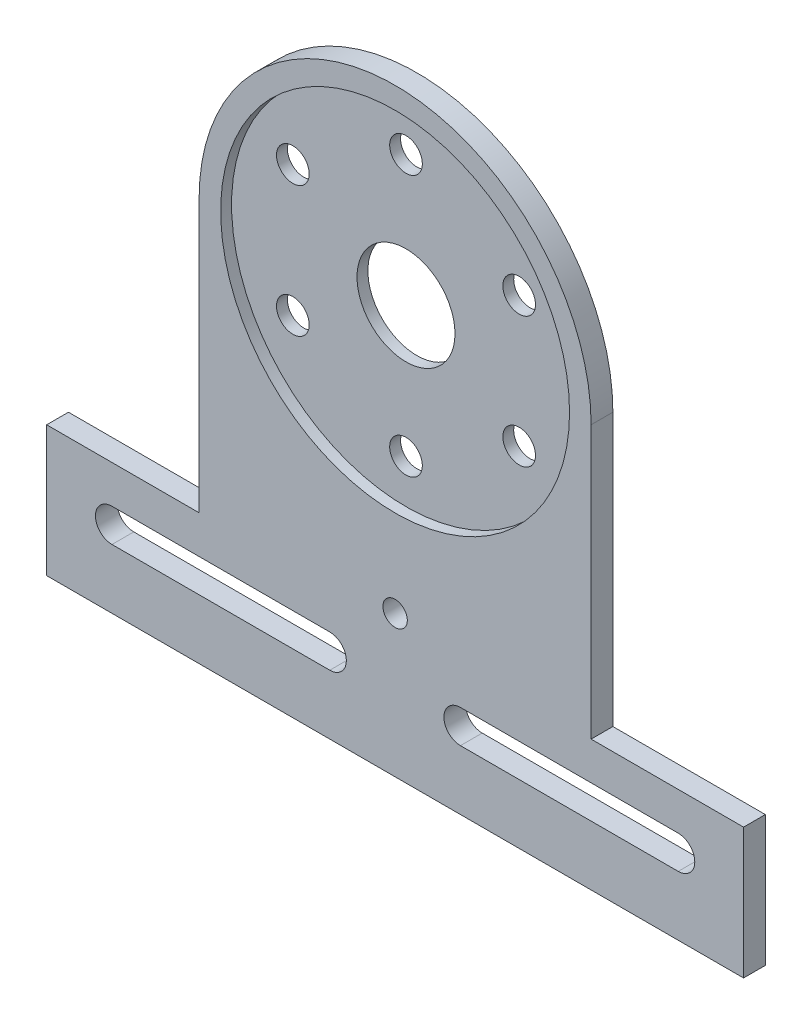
ISO-10303-21;
HEADER;
FILE_DESCRIPTION(('STEP AP214'),'2;1');
FILE_NAME('part.step','',(''),(''),'','','');
FILE_SCHEMA(('AUTOMOTIVE_DESIGN { 1 0 10303 214 1 1 1 1 }'));
ENDSEC;
DATA;
#1=APPLICATION_CONTEXT('core data for automotive mechanical design processes');
#2=APPLICATION_PROTOCOL_DEFINITION('international standard','automotive_design',2000,#1);
#3=PRODUCT_CONTEXT('',#1,'mechanical');
#4=PRODUCT('Part','Part','',(#3));
#5=PRODUCT_RELATED_PRODUCT_CATEGORY('part','',(#4));
#6=PRODUCT_DEFINITION_FORMATION('','',#4);
#7=PRODUCT_DEFINITION_CONTEXT('part definition',#1,'design');
#8=PRODUCT_DEFINITION('design','',#6,#7);
#9=PRODUCT_DEFINITION_SHAPE('','',#8);
#10=(LENGTH_UNIT() NAMED_UNIT(*) SI_UNIT(.MILLI.,.METRE.));
#11=(NAMED_UNIT(*) PLANE_ANGLE_UNIT() SI_UNIT($,.RADIAN.));
#12=(NAMED_UNIT(*) SI_UNIT($,.STERADIAN.) SOLID_ANGLE_UNIT());
#13=UNCERTAINTY_MEASURE_WITH_UNIT(LENGTH_MEASURE(1.E-05),#10,'distance_accuracy_value','');
#14=(GEOMETRIC_REPRESENTATION_CONTEXT(3) GLOBAL_UNCERTAINTY_ASSIGNED_CONTEXT((#13)) GLOBAL_UNIT_ASSIGNED_CONTEXT((#10,
#11,#12)) REPRESENTATION_CONTEXT('',''));
#15=CARTESIAN_POINT('',(0.,0.,0.));
#16=DIRECTION('',(0.,0.,1.));
#17=DIRECTION('',(1.,0.,0.));
#18=AXIS2_PLACEMENT_3D('',#15,#16,#17);
#19=CARTESIAN_POINT('',(0.,0.,6.35));
#20=DIRECTION('',(0.,0.,-1.));
#21=DIRECTION('',(-1.,0.,0.));
#22=AXIS2_PLACEMENT_3D('',#19,#20,#21);
#23=PLANE('',#22);
#24=CARTESIAN_POINT('',(0.,-76.2,6.35));
#25=DIRECTION('',(0.,0.,-1.));
#26=DIRECTION('',(-1.,0.,0.));
#27=AXIS2_PLACEMENT_3D('',#24,#25,#26);
#28=CIRCLE('',#27,3.556);
#29=CARTESIAN_POINT('',(-3.556,-76.2,6.35));
#30=VERTEX_POINT('',#29);
#31=EDGE_CURVE('E640',#30,#30,#28,.T.);
#32=ORIENTED_EDGE('',*,*,#31,.T.);
#33=EDGE_LOOP('',(#32));
#34=FACE_BOUND('',#33,.T.);
#35=CARTESIAN_POINT('',(0.,0.,6.35));
#36=DIRECTION('',(0.,0.,1.));
#37=DIRECTION('',(-1.,0.,0.));
#38=AXIS2_PLACEMENT_3D('',#35,#36,#37);
#39=CIRCLE('',#38,57.15);
#40=CARTESIAN_POINT('',(57.15,0.,6.35));
#41=VERTEX_POINT('',#40);
#42=CARTESIAN_POINT('',(-57.15,0.,6.35));
#43=VERTEX_POINT('',#42);
#44=EDGE_CURVE('E277',#41,#43,#39,.T.);
#45=ORIENTED_EDGE('',*,*,#44,.T.);
#46=DIRECTION('',(0.,-1.,0.));
#47=VECTOR('',#46,1.);
#48=CARTESIAN_POINT('',(-57.15,-79.375,6.35));
#49=LINE('',#48,#47);
#50=CARTESIAN_POINT('',(-57.15,-79.375,6.35));
#51=VERTEX_POINT('',#50);
#52=EDGE_CURVE('E280',#43,#51,#49,.T.);
#53=ORIENTED_EDGE('',*,*,#52,.T.);
#54=DIRECTION('',(-1.,0.,0.));
#55=VECTOR('',#54,1.);
#56=CARTESIAN_POINT('',(-101.6,-79.375,6.35));
#57=LINE('',#56,#55);
#58=CARTESIAN_POINT('',(-101.6,-79.375,6.35));
#59=VERTEX_POINT('',#58);
#60=EDGE_CURVE('E282',#51,#59,#57,.T.);
#61=ORIENTED_EDGE('',*,*,#60,.T.);
#62=DIRECTION('',(0.,-1.,0.));
#63=VECTOR('',#62,1.);
#64=CARTESIAN_POINT('',(-101.6,-117.475,6.35));
#65=LINE('',#64,#63);
#66=CARTESIAN_POINT('',(-101.6,-117.475,6.35));
#67=VERTEX_POINT('',#66);
#68=EDGE_CURVE('E284',#59,#67,#65,.T.);
#69=ORIENTED_EDGE('',*,*,#68,.T.);
#70=DIRECTION('',(1.,0.,0.));
#71=VECTOR('',#70,1.);
#72=CARTESIAN_POINT('',(101.6,-117.475,6.35));
#73=LINE('',#72,#71);
#74=CARTESIAN_POINT('',(101.6,-117.475,6.35));
#75=VERTEX_POINT('',#74);
#76=EDGE_CURVE('E286',#67,#75,#73,.T.);
#77=ORIENTED_EDGE('',*,*,#76,.T.);
#78=DIRECTION('',(0.,1.,0.));
#79=VECTOR('',#78,1.);
#80=CARTESIAN_POINT('',(101.6,-79.375,6.35));
#81=LINE('',#80,#79);
#82=CARTESIAN_POINT('',(101.6,-79.375,6.35));
#83=VERTEX_POINT('',#82);
#84=EDGE_CURVE('E288',#75,#83,#81,.T.);
#85=ORIENTED_EDGE('',*,*,#84,.T.);
#86=DIRECTION('',(-1.,0.,0.));
#87=VECTOR('',#86,1.);
#88=CARTESIAN_POINT('',(57.15,-79.375,6.35));
#89=LINE('',#88,#87);
#90=CARTESIAN_POINT('',(57.15,-79.375,6.35));
#91=VERTEX_POINT('',#90);
#92=EDGE_CURVE('E290',#83,#91,#89,.T.);
#93=ORIENTED_EDGE('',*,*,#92,.T.);
#94=DIRECTION('',(0.,1.,0.));
#95=VECTOR('',#94,1.);
#96=CARTESIAN_POINT('',(57.15,0.,6.35));
#97=LINE('',#96,#95);
#98=EDGE_CURVE('E292',#91,#41,#97,.T.);
#99=ORIENTED_EDGE('',*,*,#98,.T.);
#100=EDGE_LOOP('',(#45,#53,#61,#69,#77,#85,#93,#99));
#101=FACE_BOUND('',#100,.T.);
#102=CARTESIAN_POINT('',(0.,0.,6.35));
#103=DIRECTION('',(0.,0.,1.));
#104=DIRECTION('',(1.,0.,0.));
#105=AXIS2_PLACEMENT_3D('',#102,#103,#104);
#106=CIRCLE('',#105,50.8635);
#107=CARTESIAN_POINT('',(50.8635,0.,6.35));
#108=VERTEX_POINT('',#107);
#109=EDGE_CURVE('E251',#108,#108,#106,.T.);
#110=ORIENTED_EDGE('',*,*,#109,.F.);
#111=EDGE_LOOP('',(#110));
#112=FACE_BOUND('',#111,.T.);
#113=DIRECTION('',(1.,0.,0.));
#114=VECTOR('',#113,1.);
#115=CARTESIAN_POINT('',(-82.55,-100.076,6.35));
#116=LINE('',#115,#114);
#117=CARTESIAN_POINT('',(-82.55,-100.076,6.35));
#118=VERTEX_POINT('',#117);
#119=CARTESIAN_POINT('',(-19.05,-100.076,6.35));
#120=VERTEX_POINT('',#119);
#121=EDGE_CURVE('E185',#118,#120,#116,.T.);
#122=ORIENTED_EDGE('',*,*,#121,.F.);
#123=CARTESIAN_POINT('',(-82.55,-95.25,6.35));
#124=DIRECTION('',(0.,0.,1.));
#125=DIRECTION('',(1.,0.,0.));
#126=AXIS2_PLACEMENT_3D('',#123,#124,#125);
#127=CIRCLE('',#126,4.826);
#128=CARTESIAN_POINT('',(-82.55,-90.424,6.35));
#129=VERTEX_POINT('',#128);
#130=EDGE_CURVE('E181',#129,#118,#127,.T.);
#131=ORIENTED_EDGE('',*,*,#130,.F.);
#132=DIRECTION('',(-1.,0.,0.));
#133=VECTOR('',#132,1.);
#134=CARTESIAN_POINT('',(-19.05,-90.424,6.35));
#135=LINE('',#134,#133);
#136=CARTESIAN_POINT('',(-19.05,-90.424,6.35));
#137=VERTEX_POINT('',#136);
#138=EDGE_CURVE('E191',#137,#129,#135,.T.);
#139=ORIENTED_EDGE('',*,*,#138,.F.);
#140=CARTESIAN_POINT('',(-19.05,-95.25,6.35));
#141=DIRECTION('',(0.,0.,1.));
#142=DIRECTION('',(1.,0.,0.));
#143=AXIS2_PLACEMENT_3D('',#140,#141,#142);
#144=CIRCLE('',#143,4.826);
#145=EDGE_CURVE('E188',#120,#137,#144,.T.);
#146=ORIENTED_EDGE('',*,*,#145,.F.);
#147=EDGE_LOOP('',(#122,#131,#139,#146));
#148=FACE_BOUND('',#147,.T.);
#149=CARTESIAN_POINT('',(82.55,-95.25,6.35));
#150=DIRECTION('',(0.,0.,-1.));
#151=DIRECTION('',(-1.,0.,0.));
#152=AXIS2_PLACEMENT_3D('',#149,#150,#151);
#153=CIRCLE('',#152,4.826);
#154=CARTESIAN_POINT('',(82.55,-90.424,6.35));
#155=VERTEX_POINT('',#154);
#156=CARTESIAN_POINT('',(82.55,-100.076,6.35));
#157=VERTEX_POINT('',#156);
#158=EDGE_CURVE('E52',#155,#157,#153,.T.);
#159=ORIENTED_EDGE('',*,*,#158,.T.);
#160=DIRECTION('',(-1.,0.,0.));
#161=VECTOR('',#160,1.);
#162=CARTESIAN_POINT('',(82.55,-100.076,6.35));
#163=LINE('',#162,#161);
#164=CARTESIAN_POINT('',(19.05,-100.076,6.35));
#165=VERTEX_POINT('',#164);
#166=EDGE_CURVE('E167',#157,#165,#163,.T.);
#167=ORIENTED_EDGE('',*,*,#166,.T.);
#168=CARTESIAN_POINT('',(19.05,-95.25,6.35));
#169=DIRECTION('',(0.,0.,-1.));
#170=DIRECTION('',(-1.,0.,0.));
#171=AXIS2_PLACEMENT_3D('',#168,#169,#170);
#172=CIRCLE('',#171,4.826);
#173=CARTESIAN_POINT('',(19.05,-90.424,6.35));
#174=VERTEX_POINT('',#173);
#175=EDGE_CURVE('E154',#165,#174,#172,.T.);
#176=ORIENTED_EDGE('',*,*,#175,.T.);
#177=DIRECTION('',(1.,0.,0.));
#178=VECTOR('',#177,1.);
#179=CARTESIAN_POINT('',(19.05,-90.424,6.35));
#180=LINE('',#179,#178);
#181=EDGE_CURVE('E163',#174,#155,#180,.T.);
#182=ORIENTED_EDGE('',*,*,#181,.T.);
#183=EDGE_LOOP('',(#159,#167,#176,#182));
#184=FACE_BOUND('',#183,.T.);
#185=ADVANCED_FACE('F36',(#34,#101,#112,#148,#184),#23,.F.);
#186=CARTESIAN_POINT('',(0.,0.,0.));
#187=DIRECTION('',(0.,0.,-1.));
#188=DIRECTION('',(-1.,0.,0.));
#189=AXIS2_PLACEMENT_3D('',#186,#187,#188);
#190=PLANE('',#189);
#191=CARTESIAN_POINT('',(0.,-76.2,0.));
#192=DIRECTION('',(0.,0.,-1.));
#193=DIRECTION('',(-1.,0.,0.));
#194=AXIS2_PLACEMENT_3D('',#191,#192,#193);
#195=CIRCLE('',#194,3.556);
#196=CARTESIAN_POINT('',(-3.556,-76.2,0.));
#197=VERTEX_POINT('',#196);
#198=EDGE_CURVE('E643',#197,#197,#195,.T.);
#199=ORIENTED_EDGE('',*,*,#198,.F.);
#200=EDGE_LOOP('',(#199));
#201=FACE_BOUND('',#200,.T.);
#202=CARTESIAN_POINT('',(0.,0.,0.));
#203=DIRECTION('',(0.,0.,1.));
#204=DIRECTION('',(1.,0.,0.));
#205=AXIS2_PLACEMENT_3D('',#202,#203,#204);
#206=CIRCLE('',#205,14.2875);
#207=CARTESIAN_POINT('',(14.2875,0.,0.));
#208=VERTEX_POINT('',#207);
#209=EDGE_CURVE('E257',#208,#208,#206,.T.);
#210=ORIENTED_EDGE('',*,*,#209,.T.);
#211=EDGE_LOOP('',(#210));
#212=FACE_BOUND('',#211,.T.);
#213=CARTESIAN_POINT('',(0.,0.,0.));
#214=DIRECTION('',(0.,0.,1.));
#215=DIRECTION('',(-1.,0.,0.));
#216=AXIS2_PLACEMENT_3D('',#213,#214,#215);
#217=CIRCLE('',#216,57.15);
#218=CARTESIAN_POINT('',(57.15,0.,0.));
#219=VERTEX_POINT('',#218);
#220=CARTESIAN_POINT('',(-57.15,0.,0.));
#221=VERTEX_POINT('',#220);
#222=EDGE_CURVE('E260',#219,#221,#217,.T.);
#223=ORIENTED_EDGE('',*,*,#222,.F.);
#224=DIRECTION('',(0.,1.,0.));
#225=VECTOR('',#224,1.);
#226=CARTESIAN_POINT('',(57.15,0.,0.));
#227=LINE('',#226,#225);
#228=CARTESIAN_POINT('',(57.15,-79.375,0.));
#229=VERTEX_POINT('',#228);
#230=EDGE_CURVE('E275',#229,#219,#227,.T.);
#231=ORIENTED_EDGE('',*,*,#230,.F.);
#232=DIRECTION('',(-1.,0.,0.));
#233=VECTOR('',#232,1.);
#234=CARTESIAN_POINT('',(57.15,-79.375,0.));
#235=LINE('',#234,#233);
#236=CARTESIAN_POINT('',(101.6,-79.375,0.));
#237=VERTEX_POINT('',#236);
#238=EDGE_CURVE('E273',#237,#229,#235,.T.);
#239=ORIENTED_EDGE('',*,*,#238,.F.);
#240=DIRECTION('',(0.,1.,0.));
#241=VECTOR('',#240,1.);
#242=CARTESIAN_POINT('',(101.6,-79.375,0.));
#243=LINE('',#242,#241);
#244=CARTESIAN_POINT('',(101.6,-117.475,0.));
#245=VERTEX_POINT('',#244);
#246=EDGE_CURVE('E271',#245,#237,#243,.T.);
#247=ORIENTED_EDGE('',*,*,#246,.F.);
#248=DIRECTION('',(1.,0.,0.));
#249=VECTOR('',#248,1.);
#250=CARTESIAN_POINT('',(101.6,-117.475,0.));
#251=LINE('',#250,#249);
#252=CARTESIAN_POINT('',(-101.6,-117.475,0.));
#253=VERTEX_POINT('',#252);
#254=EDGE_CURVE('E269',#253,#245,#251,.T.);
#255=ORIENTED_EDGE('',*,*,#254,.F.);
#256=DIRECTION('',(0.,-1.,0.));
#257=VECTOR('',#256,1.);
#258=CARTESIAN_POINT('',(-101.6,-117.475,0.));
#259=LINE('',#258,#257);
#260=CARTESIAN_POINT('',(-101.6,-79.375,0.));
#261=VERTEX_POINT('',#260);
#262=EDGE_CURVE('E267',#261,#253,#259,.T.);
#263=ORIENTED_EDGE('',*,*,#262,.F.);
#264=DIRECTION('',(-1.,0.,0.));
#265=VECTOR('',#264,1.);
#266=CARTESIAN_POINT('',(-101.6,-79.375,0.));
#267=LINE('',#266,#265);
#268=CARTESIAN_POINT('',(-57.15,-79.375,0.));
#269=VERTEX_POINT('',#268);
#270=EDGE_CURVE('E265',#269,#261,#267,.T.);
#271=ORIENTED_EDGE('',*,*,#270,.F.);
#272=DIRECTION('',(0.,-1.,0.));
#273=VECTOR('',#272,1.);
#274=CARTESIAN_POINT('',(-57.15,-79.375,0.));
#275=LINE('',#274,#273);
#276=EDGE_CURVE('E263',#221,#269,#275,.T.);
#277=ORIENTED_EDGE('',*,*,#276,.F.);
#278=EDGE_LOOP('',(#223,#231,#239,#247,#255,#263,#271,#277));
#279=FACE_BOUND('',#278,.T.);
#280=CARTESIAN_POINT('',(0.,38.1,0.));
#281=DIRECTION('',(0.,0.,1.));
#282=DIRECTION('',(1.,0.,0.));
#283=AXIS2_PLACEMENT_3D('',#280,#281,#282);
#284=CIRCLE('',#283,4.7625);
#285=CARTESIAN_POINT('',(4.7625,38.1,0.));
#286=VERTEX_POINT('',#285);
#287=EDGE_CURVE('E248',#286,#286,#284,.T.);
#288=ORIENTED_EDGE('',*,*,#287,.T.);
#289=EDGE_LOOP('',(#288));
#290=FACE_BOUND('',#289,.T.);
#291=CARTESIAN_POINT('',(32.9955678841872,19.0499999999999,0.));
#292=DIRECTION('',(0.,0.,1.));
#293=DIRECTION('',(0.499999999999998,-0.86602540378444,0.));
#294=AXIS2_PLACEMENT_3D('',#291,#292,#293);
#295=CIRCLE('',#294,4.7625);
#296=CARTESIAN_POINT('',(35.3768178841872,14.9255540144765,0.));
#297=VERTEX_POINT('',#296);
#298=EDGE_CURVE('E242',#297,#297,#295,.T.);
#299=ORIENTED_EDGE('',*,*,#298,.T.);
#300=EDGE_LOOP('',(#299));
#301=FACE_BOUND('',#300,.T.);
#302=CARTESIAN_POINT('',(32.995567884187,-19.0500000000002,0.));
#303=DIRECTION('',(0.,0.,1.));
#304=DIRECTION('',(-0.500000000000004,-0.866025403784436,0.));
#305=AXIS2_PLACEMENT_3D('',#302,#303,#304);
#306=CIRCLE('',#305,4.7625);
#307=CARTESIAN_POINT('',(30.614317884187,-23.1744459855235,0.));
#308=VERTEX_POINT('',#307);
#309=EDGE_CURVE('E236',#308,#308,#306,.T.);
#310=ORIENTED_EDGE('',*,*,#309,.T.);
#311=EDGE_LOOP('',(#310));
#312=FACE_BOUND('',#311,.T.);
#313=CARTESIAN_POINT('',(-2.66051032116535E-13,-38.1,0.));
#314=DIRECTION('',(0.,0.,1.));
#315=DIRECTION('',(-1.,0.,0.));
#316=AXIS2_PLACEMENT_3D('',#313,#314,#315);
#317=CIRCLE('',#316,4.7625);
#318=CARTESIAN_POINT('',(-4.76250000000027,-38.1,0.));
#319=VERTEX_POINT('',#318);
#320=EDGE_CURVE('E230',#319,#319,#317,.T.);
#321=ORIENTED_EDGE('',*,*,#320,.T.);
#322=EDGE_LOOP('',(#321));
#323=FACE_BOUND('',#322,.T.);
#324=CARTESIAN_POINT('',(-32.9955678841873,-19.0499999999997,0.));
#325=DIRECTION('',(0.,0.,1.));
#326=DIRECTION('',(-0.499999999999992,0.866025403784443,0.));
#327=AXIS2_PLACEMENT_3D('',#324,#325,#326);
#328=CIRCLE('',#327,4.7625);
#329=CARTESIAN_POINT('',(-35.3768178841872,-14.9255540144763,0.));
#330=VERTEX_POINT('',#329);
#331=EDGE_CURVE('E224',#330,#330,#328,.T.);
#332=ORIENTED_EDGE('',*,*,#331,.T.);
#333=EDGE_LOOP('',(#332));
#334=FACE_BOUND('',#333,.T.);
#335=CARTESIAN_POINT('',(-32.9955678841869,19.0500000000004,0.));
#336=DIRECTION('',(0.,0.,1.));
#337=DIRECTION('',(0.50000000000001,0.866025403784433,0.));
#338=AXIS2_PLACEMENT_3D('',#335,#336,#337);
#339=CIRCLE('',#338,4.7625);
#340=CARTESIAN_POINT('',(-30.6143178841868,23.1744459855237,0.));
#341=VERTEX_POINT('',#340);
#342=EDGE_CURVE('E218',#341,#341,#339,.T.);
#343=ORIENTED_EDGE('',*,*,#342,.T.);
#344=EDGE_LOOP('',(#343));
#345=FACE_BOUND('',#344,.T.);
#346=CARTESIAN_POINT('',(-82.55,-95.25,0.));
#347=DIRECTION('',(0.,0.,1.));
#348=DIRECTION('',(1.,0.,0.));
#349=AXIS2_PLACEMENT_3D('',#346,#347,#348);
#350=CIRCLE('',#349,4.826);
#351=CARTESIAN_POINT('',(-82.55,-90.424,0.));
#352=VERTEX_POINT('',#351);
#353=CARTESIAN_POINT('',(-82.55,-100.076,0.));
#354=VERTEX_POINT('',#353);
#355=EDGE_CURVE('E194',#352,#354,#350,.T.);
#356=ORIENTED_EDGE('',*,*,#355,.T.);
#357=DIRECTION('',(1.,0.,0.));
#358=VECTOR('',#357,1.);
#359=CARTESIAN_POINT('',(-82.55,-100.076,0.));
#360=LINE('',#359,#358);
#361=CARTESIAN_POINT('',(-19.05,-100.076,0.));
#362=VERTEX_POINT('',#361);
#363=EDGE_CURVE('E197',#354,#362,#360,.T.);
#364=ORIENTED_EDGE('',*,*,#363,.T.);
#365=CARTESIAN_POINT('',(-19.05,-95.25,0.));
#366=DIRECTION('',(0.,0.,1.));
#367=DIRECTION('',(1.,0.,0.));
#368=AXIS2_PLACEMENT_3D('',#365,#366,#367);
#369=CIRCLE('',#368,4.826);
#370=CARTESIAN_POINT('',(-19.05,-90.424,0.));
#371=VERTEX_POINT('',#370);
#372=EDGE_CURVE('E200',#362,#371,#369,.T.);
#373=ORIENTED_EDGE('',*,*,#372,.T.);
#374=DIRECTION('',(-1.,0.,0.));
#375=VECTOR('',#374,1.);
#376=CARTESIAN_POINT('',(-19.05,-90.424,0.));
#377=LINE('',#376,#375);
#378=EDGE_CURVE('E203',#371,#352,#377,.T.);
#379=ORIENTED_EDGE('',*,*,#378,.T.);
#380=EDGE_LOOP('',(#356,#364,#373,#379));
#381=FACE_BOUND('',#380,.T.);
#382=DIRECTION('',(-1.,0.,0.));
#383=VECTOR('',#382,1.);
#384=CARTESIAN_POINT('',(82.55,-100.076,0.));
#385=LINE('',#384,#383);
#386=CARTESIAN_POINT('',(82.55,-100.076,0.));
#387=VERTEX_POINT('',#386);
#388=CARTESIAN_POINT('',(19.05,-100.076,0.));
#389=VERTEX_POINT('',#388);
#390=EDGE_CURVE('E177',#387,#389,#385,.T.);
#391=ORIENTED_EDGE('',*,*,#390,.F.);
#392=CARTESIAN_POINT('',(82.55,-95.25,0.));
#393=DIRECTION('',(0.,0.,-1.));
#394=DIRECTION('',(-1.,0.,0.));
#395=AXIS2_PLACEMENT_3D('',#392,#393,#394);
#396=CIRCLE('',#395,4.826);
#397=CARTESIAN_POINT('',(82.55,-90.424,0.));
#398=VERTEX_POINT('',#397);
#399=EDGE_CURVE('E169',#398,#387,#396,.T.);
#400=ORIENTED_EDGE('',*,*,#399,.F.);
#401=DIRECTION('',(1.,0.,0.));
#402=VECTOR('',#401,1.);
#403=CARTESIAN_POINT('',(19.05,-90.424,0.));
#404=LINE('',#403,#402);
#405=CARTESIAN_POINT('',(19.05,-90.424,0.));
#406=VERTEX_POINT('',#405);
#407=EDGE_CURVE('E174',#406,#398,#404,.T.);
#408=ORIENTED_EDGE('',*,*,#407,.F.);
#409=CARTESIAN_POINT('',(19.05,-95.25,0.));
#410=DIRECTION('',(0.,0.,-1.));
#411=DIRECTION('',(-1.,0.,0.));
#412=AXIS2_PLACEMENT_3D('',#409,#410,#411);
#413=CIRCLE('',#412,4.826);
#414=EDGE_CURVE('E157',#389,#406,#413,.T.);
#415=ORIENTED_EDGE('',*,*,#414,.F.);
#416=EDGE_LOOP('',(#391,#400,#408,#415));
#417=FACE_BOUND('',#416,.T.);
#418=ADVANCED_FACE('F323',(#201,#212,#279,#290,#301,#312,#323,#334,#345,#381,#417),#190,.T.);
#419=CARTESIAN_POINT('',(0.,0.,6.35));
#420=DIRECTION('',(0.,0.,-1.));
#421=DIRECTION('',(-1.,0.,0.));
#422=AXIS2_PLACEMENT_3D('',#419,#420,#421);
#423=CYLINDRICAL_SURFACE('',#422,14.2875);
#424=ORIENTED_EDGE('',*,*,#209,.F.);
#425=EDGE_LOOP('',(#424));
#426=FACE_BOUND('',#425,.T.);
#427=CARTESIAN_POINT('',(0.,0.,3.175));
#428=DIRECTION('',(0.,0.,1.));
#429=DIRECTION('',(1.,0.,0.));
#430=AXIS2_PLACEMENT_3D('',#427,#428,#429);
#431=CIRCLE('',#430,14.2875);
#432=CARTESIAN_POINT('',(14.2875,0.,3.175));
#433=VERTEX_POINT('',#432);
#434=EDGE_CURVE('E40',#433,#433,#431,.T.);
#435=ORIENTED_EDGE('',*,*,#434,.T.);
#436=EDGE_LOOP('',(#435));
#437=FACE_BOUND('',#436,.T.);
#438=ADVANCED_FACE('F369',(#426,#437),#423,.F.);
#439=CARTESIAN_POINT('',(0.,0.,6.35));
#440=DIRECTION('',(0.,0.,-1.));
#441=DIRECTION('',(-1.,0.,0.));
#442=AXIS2_PLACEMENT_3D('',#439,#440,#441);
#443=CYLINDRICAL_SURFACE('',#442,57.15);
#444=ORIENTED_EDGE('',*,*,#222,.T.);
#445=DIRECTION('',(0.,0.,-1.));
#446=VECTOR('',#445,1.);
#447=CARTESIAN_POINT('',(-57.15,0.,6.35));
#448=LINE('',#447,#446);
#449=EDGE_CURVE('E11',#43,#221,#448,.T.);
#450=ORIENTED_EDGE('',*,*,#449,.F.);
#451=ORIENTED_EDGE('',*,*,#44,.F.);
#452=DIRECTION('',(0.,0.,-1.));
#453=VECTOR('',#452,1.);
#454=CARTESIAN_POINT('',(57.15,0.,6.35));
#455=LINE('',#454,#453);
#456=EDGE_CURVE('E294',#41,#219,#455,.T.);
#457=ORIENTED_EDGE('',*,*,#456,.T.);
#458=EDGE_LOOP('',(#444,#450,#451,#457));
#459=FACE_BOUND('',#458,.T.);
#460=ADVANCED_FACE('F38',(#459),#443,.T.);
#461=CARTESIAN_POINT('',(-57.15,-79.375,6.35));
#462=DIRECTION('',(1.,0.,0.));
#463=DIRECTION('',(0.,0.,-1.));
#464=AXIS2_PLACEMENT_3D('',#461,#462,#463);
#465=PLANE('',#464);
#466=ORIENTED_EDGE('',*,*,#276,.T.);
#467=DIRECTION('',(0.,0.,-1.));
#468=VECTOR('',#467,1.);
#469=CARTESIAN_POINT('',(-57.15,-79.375,6.35));
#470=LINE('',#469,#468);
#471=EDGE_CURVE('E45',#51,#269,#470,.T.);
#472=ORIENTED_EDGE('',*,*,#471,.F.);
#473=ORIENTED_EDGE('',*,*,#52,.F.);
#474=ORIENTED_EDGE('',*,*,#449,.T.);
#475=EDGE_LOOP('',(#466,#472,#473,#474));
#476=FACE_BOUND('',#475,.T.);
#477=ADVANCED_FACE('F341',(#476),#465,.F.);
#478=CARTESIAN_POINT('',(-101.6,-79.375,6.35));
#479=DIRECTION('',(0.,-1.,0.));
#480=DIRECTION('',(0.,0.,-1.));
#481=AXIS2_PLACEMENT_3D('',#478,#479,#480);
#482=PLANE('',#481);
#483=ORIENTED_EDGE('',*,*,#270,.T.);
#484=DIRECTION('',(0.,0.,-1.));
#485=VECTOR('',#484,1.);
#486=CARTESIAN_POINT('',(-101.6,-79.375,6.35));
#487=LINE('',#486,#485);
#488=EDGE_CURVE('E309',#59,#261,#487,.T.);
#489=ORIENTED_EDGE('',*,*,#488,.F.);
#490=ORIENTED_EDGE('',*,*,#60,.F.);
#491=ORIENTED_EDGE('',*,*,#471,.T.);
#492=EDGE_LOOP('',(#483,#489,#490,#491));
#493=FACE_BOUND('',#492,.T.);
#494=ADVANCED_FACE('F317',(#493),#482,.F.);
#495=CARTESIAN_POINT('',(-101.6,-117.475,6.35));
#496=DIRECTION('',(1.,0.,0.));
#497=DIRECTION('',(0.,0.,-1.));
#498=AXIS2_PLACEMENT_3D('',#495,#496,#497);
#499=PLANE('',#498);
#500=ORIENTED_EDGE('',*,*,#262,.T.);
#501=DIRECTION('',(0.,0.,-1.));
#502=VECTOR('',#501,1.);
#503=CARTESIAN_POINT('',(-101.6,-117.475,6.35));
#504=LINE('',#503,#502);
#505=EDGE_CURVE('E306',#67,#253,#504,.T.);
#506=ORIENTED_EDGE('',*,*,#505,.F.);
#507=ORIENTED_EDGE('',*,*,#68,.F.);
#508=ORIENTED_EDGE('',*,*,#488,.T.);
#509=EDGE_LOOP('',(#500,#506,#507,#508));
#510=FACE_BOUND('',#509,.T.);
#511=ADVANCED_FACE('F329',(#510),#499,.F.);
#512=CARTESIAN_POINT('',(101.6,-117.475,6.35));
#513=DIRECTION('',(0.,1.,0.));
#514=DIRECTION('',(-1.,0.,0.));
#515=AXIS2_PLACEMENT_3D('',#512,#513,#514);
#516=PLANE('',#515);
#517=ORIENTED_EDGE('',*,*,#254,.T.);
#518=DIRECTION('',(0.,0.,-1.));
#519=VECTOR('',#518,1.);
#520=CARTESIAN_POINT('',(101.6,-117.475,6.35));
#521=LINE('',#520,#519);
#522=EDGE_CURVE('E303',#75,#245,#521,.T.);
#523=ORIENTED_EDGE('',*,*,#522,.F.);
#524=ORIENTED_EDGE('',*,*,#76,.F.);
#525=ORIENTED_EDGE('',*,*,#505,.T.);
#526=EDGE_LOOP('',(#517,#523,#524,#525));
#527=FACE_BOUND('',#526,.T.);
#528=ADVANCED_FACE('F333',(#527),#516,.F.);
#529=CARTESIAN_POINT('',(101.6,-79.375,6.35));
#530=DIRECTION('',(-1.,0.,0.));
#531=DIRECTION('',(0.,0.,1.));
#532=AXIS2_PLACEMENT_3D('',#529,#530,#531);
#533=PLANE('',#532);
#534=ORIENTED_EDGE('',*,*,#246,.T.);
#535=DIRECTION('',(0.,0.,-1.));
#536=VECTOR('',#535,1.);
#537=CARTESIAN_POINT('',(101.6,-79.375,6.35));
#538=LINE('',#537,#536);
#539=EDGE_CURVE('E300',#83,#237,#538,.T.);
#540=ORIENTED_EDGE('',*,*,#539,.F.);
#541=ORIENTED_EDGE('',*,*,#84,.F.);
#542=ORIENTED_EDGE('',*,*,#522,.T.);
#543=EDGE_LOOP('',(#534,#540,#541,#542));
#544=FACE_BOUND('',#543,.T.);
#545=ADVANCED_FACE('F354',(#544),#533,.F.);
#546=CARTESIAN_POINT('',(57.15,-79.375,6.35));
#547=DIRECTION('',(0.,-1.,0.));
#548=DIRECTION('',(0.,0.,-1.));
#549=AXIS2_PLACEMENT_3D('',#546,#547,#548);
#550=PLANE('',#549);
#551=ORIENTED_EDGE('',*,*,#238,.T.);
#552=DIRECTION('',(0.,0.,-1.));
#553=VECTOR('',#552,1.);
#554=CARTESIAN_POINT('',(57.15,-79.375,6.35));
#555=LINE('',#554,#553);
#556=EDGE_CURVE('E297',#91,#229,#555,.T.);
#557=ORIENTED_EDGE('',*,*,#556,.F.);
#558=ORIENTED_EDGE('',*,*,#92,.F.);
#559=ORIENTED_EDGE('',*,*,#539,.T.);
#560=EDGE_LOOP('',(#551,#557,#558,#559));
#561=FACE_BOUND('',#560,.T.);
#562=ADVANCED_FACE('F352',(#561),#550,.F.);
#563=CARTESIAN_POINT('',(57.15,0.,6.35));
#564=DIRECTION('',(-1.,0.,0.));
#565=DIRECTION('',(0.,-1.,0.));
#566=AXIS2_PLACEMENT_3D('',#563,#564,#565);
#567=PLANE('',#566);
#568=ORIENTED_EDGE('',*,*,#230,.T.);
#569=ORIENTED_EDGE('',*,*,#456,.F.);
#570=ORIENTED_EDGE('',*,*,#98,.F.);
#571=ORIENTED_EDGE('',*,*,#556,.T.);
#572=EDGE_LOOP('',(#568,#569,#570,#571));
#573=FACE_BOUND('',#572,.T.);
#574=ADVANCED_FACE('F347',(#573),#567,.F.);
#575=CARTESIAN_POINT('',(0.,0.,3.175));
#576=DIRECTION('',(0.,0.,1.));
#577=DIRECTION('',(1.,0.,0.));
#578=AXIS2_PLACEMENT_3D('',#575,#576,#577);
#579=CYLINDRICAL_SURFACE('',#578,50.8635);
#580=CARTESIAN_POINT('',(0.,0.,3.175));
#581=DIRECTION('',(0.,0.,1.));
#582=DIRECTION('',(1.,0.,0.));
#583=AXIS2_PLACEMENT_3D('',#580,#581,#582);
#584=CIRCLE('',#583,50.8635);
#585=CARTESIAN_POINT('',(50.8635,0.,3.175));
#586=VERTEX_POINT('',#585);
#587=EDGE_CURVE('E254',#586,#586,#584,.T.);
#588=ORIENTED_EDGE('',*,*,#587,.F.);
#589=EDGE_LOOP('',(#588));
#590=FACE_BOUND('',#589,.T.);
#591=ORIENTED_EDGE('',*,*,#109,.T.);
#592=EDGE_LOOP('',(#591));
#593=FACE_BOUND('',#592,.T.);
#594=ADVANCED_FACE('F376',(#590,#593),#579,.F.);
#595=CARTESIAN_POINT('',(0.,0.,3.175));
#596=DIRECTION('',(0.,0.,1.));
#597=DIRECTION('',(1.,0.,0.));
#598=AXIS2_PLACEMENT_3D('',#595,#596,#597);
#599=PLANE('',#598);
#600=CARTESIAN_POINT('',(-32.9955678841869,19.0500000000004,3.175));
#601=DIRECTION('',(0.,0.,1.));
#602=DIRECTION('',(0.50000000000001,0.866025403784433,0.));
#603=AXIS2_PLACEMENT_3D('',#600,#601,#602);
#604=CIRCLE('',#603,4.7625);
#605=CARTESIAN_POINT('',(-30.6143178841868,23.1744459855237,3.175));
#606=VERTEX_POINT('',#605);
#607=EDGE_CURVE('E209',#606,#606,#604,.T.);
#608=ORIENTED_EDGE('',*,*,#607,.F.);
#609=EDGE_LOOP('',(#608));
#610=FACE_BOUND('',#609,.T.);
#611=CARTESIAN_POINT('',(-32.9955678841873,-19.0499999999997,3.175));
#612=DIRECTION('',(0.,0.,1.));
#613=DIRECTION('',(-0.499999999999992,0.866025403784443,0.));
#614=AXIS2_PLACEMENT_3D('',#611,#612,#613);
#615=CIRCLE('',#614,4.7625);
#616=CARTESIAN_POINT('',(-35.3768178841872,-14.9255540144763,3.175));
#617=VERTEX_POINT('',#616);
#618=EDGE_CURVE('E221',#617,#617,#615,.T.);
#619=ORIENTED_EDGE('',*,*,#618,.F.);
#620=EDGE_LOOP('',(#619));
#621=FACE_BOUND('',#620,.T.);
#622=CARTESIAN_POINT('',(-2.66051032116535E-13,-38.1,3.175));
#623=DIRECTION('',(0.,0.,1.));
#624=DIRECTION('',(-1.,0.,0.));
#625=AXIS2_PLACEMENT_3D('',#622,#623,#624);
#626=CIRCLE('',#625,4.7625);
#627=CARTESIAN_POINT('',(-4.76250000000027,-38.1,3.175));
#628=VERTEX_POINT('',#627);
#629=EDGE_CURVE('E227',#628,#628,#626,.T.);
#630=ORIENTED_EDGE('',*,*,#629,.F.);
#631=EDGE_LOOP('',(#630));
#632=FACE_BOUND('',#631,.T.);
#633=CARTESIAN_POINT('',(32.995567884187,-19.0500000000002,3.175));
#634=DIRECTION('',(0.,0.,1.));
#635=DIRECTION('',(-0.500000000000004,-0.866025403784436,0.));
#636=AXIS2_PLACEMENT_3D('',#633,#634,#635);
#637=CIRCLE('',#636,4.7625);
#638=CARTESIAN_POINT('',(30.614317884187,-23.1744459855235,3.175));
#639=VERTEX_POINT('',#638);
#640=EDGE_CURVE('E233',#639,#639,#637,.T.);
#641=ORIENTED_EDGE('',*,*,#640,.F.);
#642=EDGE_LOOP('',(#641));
#643=FACE_BOUND('',#642,.T.);
#644=CARTESIAN_POINT('',(32.9955678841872,19.0499999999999,3.175));
#645=DIRECTION('',(0.,0.,1.));
#646=DIRECTION('',(0.499999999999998,-0.86602540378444,0.));
#647=AXIS2_PLACEMENT_3D('',#644,#645,#646);
#648=CIRCLE('',#647,4.7625);
#649=CARTESIAN_POINT('',(35.3768178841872,14.9255540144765,3.175));
#650=VERTEX_POINT('',#649);
#651=EDGE_CURVE('E239',#650,#650,#648,.T.);
#652=ORIENTED_EDGE('',*,*,#651,.F.);
#653=EDGE_LOOP('',(#652));
#654=FACE_BOUND('',#653,.T.);
#655=CARTESIAN_POINT('',(0.,38.1,3.175));
#656=DIRECTION('',(0.,0.,1.));
#657=DIRECTION('',(1.,0.,0.));
#658=AXIS2_PLACEMENT_3D('',#655,#656,#657);
#659=CIRCLE('',#658,4.7625);
#660=CARTESIAN_POINT('',(4.7625,38.1,3.175));
#661=VERTEX_POINT('',#660);
#662=EDGE_CURVE('E245',#661,#661,#659,.T.);
#663=ORIENTED_EDGE('',*,*,#662,.F.);
#664=EDGE_LOOP('',(#663));
#665=FACE_BOUND('',#664,.T.);
#666=ORIENTED_EDGE('',*,*,#434,.F.);
#667=EDGE_LOOP('',(#666));
#668=FACE_BOUND('',#667,.T.);
#669=ORIENTED_EDGE('',*,*,#587,.T.);
#670=EDGE_LOOP('',(#669));
#671=FACE_BOUND('',#670,.T.);
#672=ADVANCED_FACE('F380',(#610,#621,#632,#643,#654,#665,#668,#671),#599,.T.);
#673=CARTESIAN_POINT('',(0.,38.1,0.));
#674=DIRECTION('',(0.,0.,1.));
#675=DIRECTION('',(1.,0.,0.));
#676=AXIS2_PLACEMENT_3D('',#673,#674,#675);
#677=CYLINDRICAL_SURFACE('',#676,4.7625);
#678=ORIENTED_EDGE('',*,*,#287,.F.);
#679=EDGE_LOOP('',(#678));
#680=FACE_BOUND('',#679,.T.);
#681=ORIENTED_EDGE('',*,*,#662,.T.);
#682=EDGE_LOOP('',(#681));
#683=FACE_BOUND('',#682,.T.);
#684=ADVANCED_FACE('F386',(#680,#683),#677,.F.);
#685=CARTESIAN_POINT('',(32.9955678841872,19.0499999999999,0.));
#686=DIRECTION('',(0.,0.,1.));
#687=DIRECTION('',(1.,0.,0.));
#688=AXIS2_PLACEMENT_3D('',#685,#686,#687);
#689=CYLINDRICAL_SURFACE('',#688,4.7625);
#690=ORIENTED_EDGE('',*,*,#298,.F.);
#691=EDGE_LOOP('',(#690));
#692=FACE_BOUND('',#691,.T.);
#693=ORIENTED_EDGE('',*,*,#651,.T.);
#694=EDGE_LOOP('',(#693));
#695=FACE_BOUND('',#694,.T.);
#696=ADVANCED_FACE('F458',(#692,#695),#689,.F.);
#697=CARTESIAN_POINT('',(32.995567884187,-19.0500000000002,0.));
#698=DIRECTION('',(0.,0.,1.));
#699=DIRECTION('',(1.,0.,0.));
#700=AXIS2_PLACEMENT_3D('',#697,#698,#699);
#701=CYLINDRICAL_SURFACE('',#700,4.7625);
#702=ORIENTED_EDGE('',*,*,#309,.F.);
#703=EDGE_LOOP('',(#702));
#704=FACE_BOUND('',#703,.T.);
#705=ORIENTED_EDGE('',*,*,#640,.T.);
#706=EDGE_LOOP('',(#705));
#707=FACE_BOUND('',#706,.T.);
#708=ADVANCED_FACE('F477',(#704,#707),#701,.F.);
#709=CARTESIAN_POINT('',(-2.66051032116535E-13,-38.1,0.));
#710=DIRECTION('',(0.,0.,1.));
#711=DIRECTION('',(1.,0.,0.));
#712=AXIS2_PLACEMENT_3D('',#709,#710,#711);
#713=CYLINDRICAL_SURFACE('',#712,4.7625);
#714=ORIENTED_EDGE('',*,*,#320,.F.);
#715=EDGE_LOOP('',(#714));
#716=FACE_BOUND('',#715,.T.);
#717=ORIENTED_EDGE('',*,*,#629,.T.);
#718=EDGE_LOOP('',(#717));
#719=FACE_BOUND('',#718,.T.);
#720=ADVANCED_FACE('F488',(#716,#719),#713,.F.);
#721=CARTESIAN_POINT('',(-32.9955678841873,-19.0499999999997,0.));
#722=DIRECTION('',(0.,0.,1.));
#723=DIRECTION('',(1.,0.,0.));
#724=AXIS2_PLACEMENT_3D('',#721,#722,#723);
#725=CYLINDRICAL_SURFACE('',#724,4.7625);
#726=ORIENTED_EDGE('',*,*,#331,.F.);
#727=EDGE_LOOP('',(#726));
#728=FACE_BOUND('',#727,.T.);
#729=ORIENTED_EDGE('',*,*,#618,.T.);
#730=EDGE_LOOP('',(#729));
#731=FACE_BOUND('',#730,.T.);
#732=ADVANCED_FACE('F499',(#728,#731),#725,.F.);
#733=CARTESIAN_POINT('',(-32.9955678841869,19.0500000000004,0.));
#734=DIRECTION('',(0.,0.,1.));
#735=DIRECTION('',(1.,0.,0.));
#736=AXIS2_PLACEMENT_3D('',#733,#734,#735);
#737=CYLINDRICAL_SURFACE('',#736,4.7625);
#738=ORIENTED_EDGE('',*,*,#342,.F.);
#739=EDGE_LOOP('',(#738));
#740=FACE_BOUND('',#739,.T.);
#741=ORIENTED_EDGE('',*,*,#607,.T.);
#742=EDGE_LOOP('',(#741));
#743=FACE_BOUND('',#742,.T.);
#744=ADVANCED_FACE('F510',(#740,#743),#737,.F.);
#745=CARTESIAN_POINT('',(-82.55,-95.25,0.));
#746=DIRECTION('',(0.,0.,1.));
#747=DIRECTION('',(1.,0.,0.));
#748=AXIS2_PLACEMENT_3D('',#745,#746,#747);
#749=CYLINDRICAL_SURFACE('',#748,4.826);
#750=ORIENTED_EDGE('',*,*,#130,.T.);
#751=DIRECTION('',(0.,0.,1.));
#752=VECTOR('',#751,1.);
#753=CARTESIAN_POINT('',(-82.55,-100.076,0.));
#754=LINE('',#753,#752);
#755=EDGE_CURVE('E206',#354,#118,#754,.T.);
#756=ORIENTED_EDGE('',*,*,#755,.F.);
#757=ORIENTED_EDGE('',*,*,#355,.F.);
#758=DIRECTION('',(0.,0.,1.));
#759=VECTOR('',#758,1.);
#760=CARTESIAN_POINT('',(-82.55,-90.424,0.));
#761=LINE('',#760,#759);
#762=EDGE_CURVE('E207',#352,#129,#761,.T.);
#763=ORIENTED_EDGE('',*,*,#762,.T.);
#764=EDGE_LOOP('',(#750,#756,#757,#763));
#765=FACE_BOUND('',#764,.T.);
#766=ADVANCED_FACE('F520',(#765),#749,.F.);
#767=CARTESIAN_POINT('',(-19.05,-90.424,0.));
#768=DIRECTION('',(0.,1.,0.));
#769=DIRECTION('',(-1.,0.,0.));
#770=AXIS2_PLACEMENT_3D('',#767,#768,#769);
#771=PLANE('',#770);
#772=ORIENTED_EDGE('',*,*,#138,.T.);
#773=ORIENTED_EDGE('',*,*,#762,.F.);
#774=ORIENTED_EDGE('',*,*,#378,.F.);
#775=DIRECTION('',(0.,0.,1.));
#776=VECTOR('',#775,1.);
#777=CARTESIAN_POINT('',(-19.05,-90.424,0.));
#778=LINE('',#777,#776);
#779=EDGE_CURVE('E210',#371,#137,#778,.T.);
#780=ORIENTED_EDGE('',*,*,#779,.T.);
#781=EDGE_LOOP('',(#772,#773,#774,#780));
#782=FACE_BOUND('',#781,.T.);
#783=ADVANCED_FACE('F530',(#782),#771,.F.);
#784=CARTESIAN_POINT('',(-19.05,-95.25,0.));
#785=DIRECTION('',(0.,0.,1.));
#786=DIRECTION('',(1.,0.,0.));
#787=AXIS2_PLACEMENT_3D('',#784,#785,#786);
#788=CYLINDRICAL_SURFACE('',#787,4.826);
#789=ORIENTED_EDGE('',*,*,#145,.T.);
#790=ORIENTED_EDGE('',*,*,#779,.F.);
#791=ORIENTED_EDGE('',*,*,#372,.F.);
#792=DIRECTION('',(0.,0.,1.));
#793=VECTOR('',#792,1.);
#794=CARTESIAN_POINT('',(-19.05,-100.076,0.));
#795=LINE('',#794,#793);
#796=EDGE_CURVE('E212',#362,#120,#795,.T.);
#797=ORIENTED_EDGE('',*,*,#796,.T.);
#798=EDGE_LOOP('',(#789,#790,#791,#797));
#799=FACE_BOUND('',#798,.T.);
#800=ADVANCED_FACE('F541',(#799),#788,.F.);
#801=CARTESIAN_POINT('',(-82.55,-100.076,0.));
#802=DIRECTION('',(0.,-1.,0.));
#803=DIRECTION('',(0.,0.,-1.));
#804=AXIS2_PLACEMENT_3D('',#801,#802,#803);
#805=PLANE('',#804);
#806=ORIENTED_EDGE('',*,*,#121,.T.);
#807=ORIENTED_EDGE('',*,*,#796,.F.);
#808=ORIENTED_EDGE('',*,*,#363,.F.);
#809=ORIENTED_EDGE('',*,*,#755,.T.);
#810=EDGE_LOOP('',(#806,#807,#808,#809));
#811=FACE_BOUND('',#810,.T.);
#812=ADVANCED_FACE('F552',(#811),#805,.F.);
#813=CARTESIAN_POINT('',(82.55,-95.25,0.));
#814=DIRECTION('',(0.,0.,1.));
#815=DIRECTION('',(1.,0.,0.));
#816=AXIS2_PLACEMENT_3D('',#813,#814,#815);
#817=CYLINDRICAL_SURFACE('',#816,4.826);
#818=ORIENTED_EDGE('',*,*,#158,.F.);
#819=DIRECTION('',(0.,0.,1.));
#820=VECTOR('',#819,1.);
#821=CARTESIAN_POINT('',(82.55,-90.424,0.));
#822=LINE('',#821,#820);
#823=EDGE_CURVE('E160',#398,#155,#822,.T.);
#824=ORIENTED_EDGE('',*,*,#823,.F.);
#825=ORIENTED_EDGE('',*,*,#399,.T.);
#826=DIRECTION('',(0.,0.,1.));
#827=VECTOR('',#826,1.);
#828=CARTESIAN_POINT('',(82.55,-100.076,0.));
#829=LINE('',#828,#827);
#830=EDGE_CURVE('E179',#387,#157,#829,.T.);
#831=ORIENTED_EDGE('',*,*,#830,.T.);
#832=EDGE_LOOP('',(#818,#824,#825,#831));
#833=FACE_BOUND('',#832,.T.);
#834=ADVANCED_FACE('F564',(#833),#817,.F.);
#835=CARTESIAN_POINT('',(82.55,-100.076,0.));
#836=DIRECTION('',(0.,1.,0.));
#837=DIRECTION('',(0.,0.,1.));
#838=AXIS2_PLACEMENT_3D('',#835,#836,#837);
#839=PLANE('',#838);
#840=ORIENTED_EDGE('',*,*,#166,.F.);
#841=ORIENTED_EDGE('',*,*,#830,.F.);
#842=ORIENTED_EDGE('',*,*,#390,.T.);
#843=DIRECTION('',(0.,0.,1.));
#844=VECTOR('',#843,1.);
#845=CARTESIAN_POINT('',(19.05,-100.076,0.));
#846=LINE('',#845,#844);
#847=EDGE_CURVE('E159',#389,#165,#846,.T.);
#848=ORIENTED_EDGE('',*,*,#847,.T.);
#849=EDGE_LOOP('',(#840,#841,#842,#848));
#850=FACE_BOUND('',#849,.T.);
#851=ADVANCED_FACE('F575',(#850),#839,.T.);
#852=CARTESIAN_POINT('',(19.05,-95.25,0.));
#853=DIRECTION('',(0.,0.,1.));
#854=DIRECTION('',(1.,0.,0.));
#855=AXIS2_PLACEMENT_3D('',#852,#853,#854);
#856=CYLINDRICAL_SURFACE('',#855,4.826);
#857=ORIENTED_EDGE('',*,*,#175,.F.);
#858=ORIENTED_EDGE('',*,*,#847,.F.);
#859=ORIENTED_EDGE('',*,*,#414,.T.);
#860=DIRECTION('',(0.,0.,1.));
#861=VECTOR('',#860,1.);
#862=CARTESIAN_POINT('',(19.05,-90.424,0.));
#863=LINE('',#862,#861);
#864=EDGE_CURVE('E60',#406,#174,#863,.T.);
#865=ORIENTED_EDGE('',*,*,#864,.T.);
#866=EDGE_LOOP('',(#857,#858,#859,#865));
#867=FACE_BOUND('',#866,.T.);
#868=ADVANCED_FACE('F151',(#867),#856,.F.);
#869=CARTESIAN_POINT('',(19.05,-90.424,0.));
#870=DIRECTION('',(0.,-1.,0.));
#871=DIRECTION('',(1.,0.,0.));
#872=AXIS2_PLACEMENT_3D('',#869,#870,#871);
#873=PLANE('',#872);
#874=ORIENTED_EDGE('',*,*,#181,.F.);
#875=ORIENTED_EDGE('',*,*,#864,.F.);
#876=ORIENTED_EDGE('',*,*,#407,.T.);
#877=ORIENTED_EDGE('',*,*,#823,.T.);
#878=EDGE_LOOP('',(#874,#875,#876,#877));
#879=FACE_BOUND('',#878,.T.);
#880=ADVANCED_FACE('F164',(#879),#873,.T.);
#881=CARTESIAN_POINT('',(0.,-76.2,6.35));
#882=DIRECTION('',(0.,0.,-1.));
#883=DIRECTION('',(-1.,0.,0.));
#884=AXIS2_PLACEMENT_3D('',#881,#882,#883);
#885=CYLINDRICAL_SURFACE('',#884,3.556);
#886=ORIENTED_EDGE('',*,*,#31,.F.);
#887=EDGE_LOOP('',(#886));
#888=FACE_BOUND('',#887,.T.);
#889=ORIENTED_EDGE('',*,*,#198,.T.);
#890=EDGE_LOOP('',(#889));
#891=FACE_BOUND('',#890,.T.);
#892=ADVANCED_FACE('F601',(#888,#891),#885,.F.);
#893=CLOSED_SHELL('',(#185,#418,#438,#460,#477,#494,#511,#528,#545,#562,#574,#594,#672,#684,
#696,#708,#720,#732,#744,#766,#783,#800,#812,#834,#851,#868,#880,#892));
#894=MANIFOLD_SOLID_BREP('B2',#893);
#895=ADVANCED_BREP_SHAPE_REPRESENTATION('',(#18,#894),#14);
#896=SHAPE_DEFINITION_REPRESENTATION(#9,#895);
ENDSEC;
END-ISO-10303-21;
